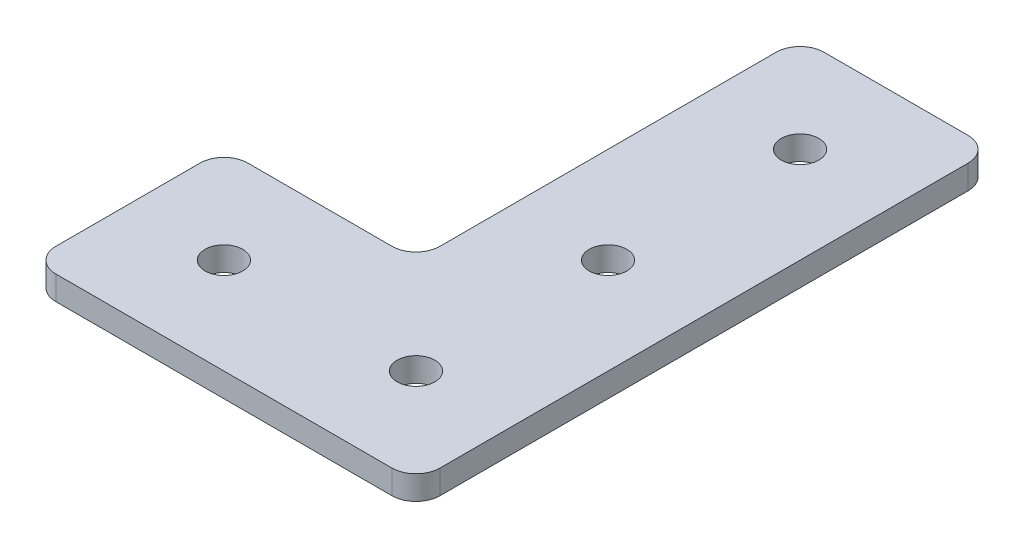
ISO-10303-21;
HEADER;
FILE_DESCRIPTION(('STEP AP214'),'2;1');
FILE_NAME('part.step','',(''),(''),'','','');
FILE_SCHEMA(('AUTOMOTIVE_DESIGN { 1 0 10303 214 1 1 1 1 }'));
ENDSEC;
DATA;
#1=APPLICATION_CONTEXT('core data for automotive mechanical design processes');
#2=APPLICATION_PROTOCOL_DEFINITION('international standard','automotive_design',2000,#1);
#3=PRODUCT_CONTEXT('',#1,'mechanical');
#4=PRODUCT('Part','Part','',(#3));
#5=PRODUCT_RELATED_PRODUCT_CATEGORY('part','',(#4));
#6=PRODUCT_DEFINITION_FORMATION('','',#4);
#7=PRODUCT_DEFINITION_CONTEXT('part definition',#1,'design');
#8=PRODUCT_DEFINITION('design','',#6,#7);
#9=PRODUCT_DEFINITION_SHAPE('','',#8);
#10=(LENGTH_UNIT() NAMED_UNIT(*) SI_UNIT(.MILLI.,.METRE.));
#11=(NAMED_UNIT(*) PLANE_ANGLE_UNIT() SI_UNIT($,.RADIAN.));
#12=(NAMED_UNIT(*) SI_UNIT($,.STERADIAN.) SOLID_ANGLE_UNIT());
#13=UNCERTAINTY_MEASURE_WITH_UNIT(LENGTH_MEASURE(1.E-05),#10,'distance_accuracy_value','');
#14=(GEOMETRIC_REPRESENTATION_CONTEXT(3) GLOBAL_UNCERTAINTY_ASSIGNED_CONTEXT((#13)) GLOBAL_UNIT_ASSIGNED_CONTEXT((#10,
#11,#12)) REPRESENTATION_CONTEXT('',''));
#15=CARTESIAN_POINT('',(0.,0.,0.));
#16=DIRECTION('',(0.,0.,1.));
#17=DIRECTION('',(1.,0.,0.));
#18=AXIS2_PLACEMENT_3D('',#15,#16,#17);
#19=CARTESIAN_POINT('',(0.,3.175,0.));
#20=DIRECTION('',(0.,1.,0.));
#21=DIRECTION('',(0.,0.,1.));
#22=AXIS2_PLACEMENT_3D('',#19,#20,#21);
#23=PLANE('',#22);
#24=CARTESIAN_POINT('',(12.7,3.175,-12.7));
#25=DIRECTION('',(0.,1.,0.));
#26=DIRECTION('',(0.,0.,1.));
#27=AXIS2_PLACEMENT_3D('',#24,#25,#26);
#28=CIRCLE('',#27,2.4892);
#29=CARTESIAN_POINT('',(12.7,3.175,-10.2108));
#30=VERTEX_POINT('',#29);
#31=EDGE_CURVE('E424',#30,#30,#28,.T.);
#32=ORIENTED_EDGE('',*,*,#31,.F.);
#33=EDGE_LOOP('',(#32));
#34=FACE_BOUND('',#33,.T.);
#35=CARTESIAN_POINT('',(12.7,3.175,12.7));
#36=DIRECTION('',(0.,1.,0.));
#37=DIRECTION('',(0.,0.,1.));
#38=AXIS2_PLACEMENT_3D('',#35,#36,#37);
#39=CIRCLE('',#38,2.4892);
#40=CARTESIAN_POINT('',(12.7,3.175,15.1892));
#41=VERTEX_POINT('',#40);
#42=EDGE_CURVE('E234',#41,#41,#39,.T.);
#43=ORIENTED_EDGE('',*,*,#42,.F.);
#44=EDGE_LOOP('',(#43));
#45=FACE_BOUND('',#44,.T.);
#46=DIRECTION('',(1.,0.,0.));
#47=VECTOR('',#46,1.);
#48=CARTESIAN_POINT('',(25.4,3.175,25.4));
#49=LINE('',#48,#47);
#50=CARTESIAN_POINT('',(-22.225,3.175,25.4));
#51=VERTEX_POINT('',#50);
#52=CARTESIAN_POINT('',(22.225,3.175,25.4));
#53=VERTEX_POINT('',#52);
#54=EDGE_CURVE('E223',#51,#53,#49,.T.);
#55=ORIENTED_EDGE('',*,*,#54,.T.);
#56=CARTESIAN_POINT('',(22.225,3.175,22.225));
#57=DIRECTION('',(0.,1.,0.));
#58=DIRECTION('',(0.,0.,1.));
#59=AXIS2_PLACEMENT_3D('',#56,#57,#58);
#60=CIRCLE('',#59,3.175);
#61=CARTESIAN_POINT('',(25.4,3.175,22.225));
#62=VERTEX_POINT('',#61);
#63=EDGE_CURVE('E182',#53,#62,#60,.T.);
#64=ORIENTED_EDGE('',*,*,#63,.T.);
#65=DIRECTION('',(0.,0.,-1.));
#66=VECTOR('',#65,1.);
#67=CARTESIAN_POINT('',(25.4,3.175,-50.8));
#68=LINE('',#67,#66);
#69=CARTESIAN_POINT('',(25.4,3.175,-47.625));
#70=VERTEX_POINT('',#69);
#71=EDGE_CURVE('E145',#62,#70,#68,.T.);
#72=ORIENTED_EDGE('',*,*,#71,.T.);
#73=CARTESIAN_POINT('',(22.225,3.175,-47.625));
#74=DIRECTION('',(0.,1.,0.));
#75=DIRECTION('',(0.,0.,1.));
#76=AXIS2_PLACEMENT_3D('',#73,#74,#75);
#77=CIRCLE('',#76,3.175);
#78=CARTESIAN_POINT('',(22.225,3.175,-50.8));
#79=VERTEX_POINT('',#78);
#80=EDGE_CURVE('E180',#70,#79,#77,.T.);
#81=ORIENTED_EDGE('',*,*,#80,.T.);
#82=DIRECTION('',(-1.,0.,0.));
#83=VECTOR('',#82,1.);
#84=CARTESIAN_POINT('',(0.,3.175,-50.8));
#85=LINE('',#84,#83);
#86=CARTESIAN_POINT('',(3.175,3.175,-50.8));
#87=VERTEX_POINT('',#86);
#88=EDGE_CURVE('E231',#79,#87,#85,.T.);
#89=ORIENTED_EDGE('',*,*,#88,.T.);
#90=CARTESIAN_POINT('',(3.175,3.175,-47.625));
#91=DIRECTION('',(0.,1.,0.));
#92=DIRECTION('',(0.,0.,1.));
#93=AXIS2_PLACEMENT_3D('',#90,#91,#92);
#94=CIRCLE('',#93,3.175);
#95=CARTESIAN_POINT('',(0.,3.175,-47.625));
#96=VERTEX_POINT('',#95);
#97=EDGE_CURVE('E57',#87,#96,#94,.T.);
#98=ORIENTED_EDGE('',*,*,#97,.T.);
#99=DIRECTION('',(0.,0.,1.));
#100=VECTOR('',#99,1.);
#101=CARTESIAN_POINT('',(0.,3.175,0.));
#102=LINE('',#101,#100);
#103=CARTESIAN_POINT('',(0.,3.175,-3.175));
#104=VERTEX_POINT('',#103);
#105=EDGE_CURVE('E164',#96,#104,#102,.T.);
#106=ORIENTED_EDGE('',*,*,#105,.T.);
#107=CARTESIAN_POINT('',(-3.175,3.175,-3.175));
#108=DIRECTION('',(0.,1.,0.));
#109=DIRECTION('',(0.,0.,1.));
#110=AXIS2_PLACEMENT_3D('',#107,#108,#109);
#111=CIRCLE('',#110,3.175);
#112=CARTESIAN_POINT('',(-3.175,3.175,0.));
#113=VERTEX_POINT('',#112);
#114=EDGE_CURVE('E11',#104,#113,#111,.F.);
#115=ORIENTED_EDGE('',*,*,#114,.T.);
#116=DIRECTION('',(-1.,0.,0.));
#117=VECTOR('',#116,1.);
#118=CARTESIAN_POINT('',(-25.4,3.175,0.));
#119=LINE('',#118,#117);
#120=CARTESIAN_POINT('',(-22.225,3.175,0.));
#121=VERTEX_POINT('',#120);
#122=EDGE_CURVE('E163',#113,#121,#119,.T.);
#123=ORIENTED_EDGE('',*,*,#122,.T.);
#124=CARTESIAN_POINT('',(-22.225,3.175,3.175));
#125=DIRECTION('',(0.,1.,0.));
#126=DIRECTION('',(0.,0.,1.));
#127=AXIS2_PLACEMENT_3D('',#124,#125,#126);
#128=CIRCLE('',#127,3.175);
#129=CARTESIAN_POINT('',(-25.4,3.175,3.175));
#130=VERTEX_POINT('',#129);
#131=EDGE_CURVE('E177',#121,#130,#128,.T.);
#132=ORIENTED_EDGE('',*,*,#131,.T.);
#133=DIRECTION('',(0.,0.,1.));
#134=VECTOR('',#133,1.);
#135=CARTESIAN_POINT('',(-25.4,3.175,25.4));
#136=LINE('',#135,#134);
#137=CARTESIAN_POINT('',(-25.4,3.175,22.225));
#138=VERTEX_POINT('',#137);
#139=EDGE_CURVE('E220',#130,#138,#136,.T.);
#140=ORIENTED_EDGE('',*,*,#139,.T.);
#141=CARTESIAN_POINT('',(-22.225,3.175,22.225));
#142=DIRECTION('',(0.,1.,0.));
#143=DIRECTION('',(0.,0.,1.));
#144=AXIS2_PLACEMENT_3D('',#141,#142,#143);
#145=CIRCLE('',#144,3.175);
#146=EDGE_CURVE('E175',#138,#51,#145,.T.);
#147=ORIENTED_EDGE('',*,*,#146,.T.);
#148=EDGE_LOOP('',(#55,#64,#72,#81,#89,#98,#106,#115,#123,#132,#140,#147));
#149=FACE_BOUND('',#148,.T.);
#150=CARTESIAN_POINT('',(-12.7,3.175,12.7));
#151=DIRECTION('',(0.,1.,0.));
#152=DIRECTION('',(0.,0.,1.));
#153=AXIS2_PLACEMENT_3D('',#150,#151,#152);
#154=CIRCLE('',#153,2.4892);
#155=CARTESIAN_POINT('',(-12.7,3.175,15.1892));
#156=VERTEX_POINT('',#155);
#157=EDGE_CURVE('E418',#156,#156,#154,.T.);
#158=ORIENTED_EDGE('',*,*,#157,.F.);
#159=EDGE_LOOP('',(#158));
#160=FACE_BOUND('',#159,.T.);
#161=CARTESIAN_POINT('',(12.7,3.175,-38.1));
#162=DIRECTION('',(0.,1.,0.));
#163=DIRECTION('',(0.,0.,1.));
#164=AXIS2_PLACEMENT_3D('',#161,#162,#163);
#165=CIRCLE('',#164,2.4892);
#166=CARTESIAN_POINT('',(12.7,3.175,-35.6108));
#167=VERTEX_POINT('',#166);
#168=EDGE_CURVE('E430',#167,#167,#165,.T.);
#169=ORIENTED_EDGE('',*,*,#168,.F.);
#170=EDGE_LOOP('',(#169));
#171=FACE_BOUND('',#170,.T.);
#172=ADVANCED_FACE('F35',(#34,#45,#149,#160,#171),#23,.T.);
#173=CARTESIAN_POINT('',(0.,0.,0.));
#174=DIRECTION('',(0.,1.,0.));
#175=DIRECTION('',(0.,0.,1.));
#176=AXIS2_PLACEMENT_3D('',#173,#174,#175);
#177=PLANE('',#176);
#178=DIRECTION('',(0.,0.,-1.));
#179=VECTOR('',#178,1.);
#180=CARTESIAN_POINT('',(25.4,0.,-50.8));
#181=LINE('',#180,#179);
#182=CARTESIAN_POINT('',(25.4,0.,22.225));
#183=VERTEX_POINT('',#182);
#184=CARTESIAN_POINT('',(25.4,0.,-47.625));
#185=VERTEX_POINT('',#184);
#186=EDGE_CURVE('E142',#183,#185,#181,.T.);
#187=ORIENTED_EDGE('',*,*,#186,.F.);
#188=CARTESIAN_POINT('',(22.225,0.,22.225));
#189=DIRECTION('',(0.,1.,0.));
#190=DIRECTION('',(0.,0.,1.));
#191=AXIS2_PLACEMENT_3D('',#188,#189,#190);
#192=CIRCLE('',#191,3.175);
#193=CARTESIAN_POINT('',(22.225,0.,25.4));
#194=VERTEX_POINT('',#193);
#195=EDGE_CURVE('E125',#183,#194,#192,.F.);
#196=ORIENTED_EDGE('',*,*,#195,.T.);
#197=DIRECTION('',(1.,0.,0.));
#198=VECTOR('',#197,1.);
#199=CARTESIAN_POINT('',(25.4,0.,25.4));
#200=LINE('',#199,#198);
#201=CARTESIAN_POINT('',(-22.225,0.,25.4));
#202=VERTEX_POINT('',#201);
#203=EDGE_CURVE('E153',#202,#194,#200,.T.);
#204=ORIENTED_EDGE('',*,*,#203,.F.);
#205=CARTESIAN_POINT('',(-22.225,0.,22.225));
#206=DIRECTION('',(0.,1.,0.));
#207=DIRECTION('',(0.,0.,1.));
#208=AXIS2_PLACEMENT_3D('',#205,#206,#207);
#209=CIRCLE('',#208,3.175);
#210=CARTESIAN_POINT('',(-25.4,0.,22.225));
#211=VERTEX_POINT('',#210);
#212=EDGE_CURVE('E146',#202,#211,#209,.F.);
#213=ORIENTED_EDGE('',*,*,#212,.T.);
#214=DIRECTION('',(0.,0.,1.));
#215=VECTOR('',#214,1.);
#216=CARTESIAN_POINT('',(-25.4,0.,25.4));
#217=LINE('',#216,#215);
#218=CARTESIAN_POINT('',(-25.4,0.,3.175));
#219=VERTEX_POINT('',#218);
#220=EDGE_CURVE('E158',#219,#211,#217,.T.);
#221=ORIENTED_EDGE('',*,*,#220,.F.);
#222=CARTESIAN_POINT('',(-22.225,0.,3.175));
#223=DIRECTION('',(0.,1.,0.));
#224=DIRECTION('',(0.,0.,1.));
#225=AXIS2_PLACEMENT_3D('',#222,#223,#224);
#226=CIRCLE('',#225,3.175);
#227=CARTESIAN_POINT('',(-22.225,0.,0.));
#228=VERTEX_POINT('',#227);
#229=EDGE_CURVE('E167',#219,#228,#226,.F.);
#230=ORIENTED_EDGE('',*,*,#229,.T.);
#231=DIRECTION('',(-1.,0.,0.));
#232=VECTOR('',#231,1.);
#233=CARTESIAN_POINT('',(-25.4,0.,0.));
#234=LINE('',#233,#232);
#235=CARTESIAN_POINT('',(-3.175,0.,0.));
#236=VERTEX_POINT('',#235);
#237=EDGE_CURVE('E205',#236,#228,#234,.T.);
#238=ORIENTED_EDGE('',*,*,#237,.F.);
#239=CARTESIAN_POINT('',(-3.175,0.,-3.175));
#240=DIRECTION('',(0.,1.,0.));
#241=DIRECTION('',(0.,0.,1.));
#242=AXIS2_PLACEMENT_3D('',#239,#240,#241);
#243=CIRCLE('',#242,3.175);
#244=CARTESIAN_POINT('',(0.,0.,-3.175));
#245=VERTEX_POINT('',#244);
#246=EDGE_CURVE('E43',#236,#245,#243,.T.);
#247=ORIENTED_EDGE('',*,*,#246,.T.);
#248=DIRECTION('',(0.,0.,1.));
#249=VECTOR('',#248,1.);
#250=CARTESIAN_POINT('',(0.,0.,0.));
#251=LINE('',#250,#249);
#252=CARTESIAN_POINT('',(0.,0.,-47.625));
#253=VERTEX_POINT('',#252);
#254=EDGE_CURVE('E156',#253,#245,#251,.T.);
#255=ORIENTED_EDGE('',*,*,#254,.F.);
#256=CARTESIAN_POINT('',(3.175,0.,-47.625));
#257=DIRECTION('',(0.,1.,0.));
#258=DIRECTION('',(0.,0.,1.));
#259=AXIS2_PLACEMENT_3D('',#256,#257,#258);
#260=CIRCLE('',#259,3.175);
#261=CARTESIAN_POINT('',(3.175,0.,-50.8));
#262=VERTEX_POINT('',#261);
#263=EDGE_CURVE('E169',#253,#262,#260,.F.);
#264=ORIENTED_EDGE('',*,*,#263,.T.);
#265=DIRECTION('',(-1.,0.,0.));
#266=VECTOR('',#265,1.);
#267=CARTESIAN_POINT('',(0.,0.,-50.8));
#268=LINE('',#267,#266);
#269=CARTESIAN_POINT('',(22.225,0.,-50.8));
#270=VERTEX_POINT('',#269);
#271=EDGE_CURVE('E152',#270,#262,#268,.T.);
#272=ORIENTED_EDGE('',*,*,#271,.F.);
#273=CARTESIAN_POINT('',(22.225,0.,-47.625));
#274=DIRECTION('',(0.,1.,0.));
#275=DIRECTION('',(0.,0.,1.));
#276=AXIS2_PLACEMENT_3D('',#273,#274,#275);
#277=CIRCLE('',#276,3.175);
#278=EDGE_CURVE('E136',#270,#185,#277,.F.);
#279=ORIENTED_EDGE('',*,*,#278,.T.);
#280=EDGE_LOOP('',(#187,#196,#204,#213,#221,#230,#238,#247,#255,#264,#272,#279));
#281=FACE_BOUND('',#280,.T.);
#282=CARTESIAN_POINT('',(12.7,0.,12.7));
#283=DIRECTION('',(0.,1.,0.));
#284=DIRECTION('',(0.,0.,1.));
#285=AXIS2_PLACEMENT_3D('',#282,#283,#284);
#286=CIRCLE('',#285,2.4892);
#287=CARTESIAN_POINT('',(12.7,0.,15.1892));
#288=VERTEX_POINT('',#287);
#289=EDGE_CURVE('E226',#288,#288,#286,.T.);
#290=ORIENTED_EDGE('',*,*,#289,.T.);
#291=EDGE_LOOP('',(#290));
#292=FACE_BOUND('',#291,.T.);
#293=CARTESIAN_POINT('',(-12.7,0.,12.7));
#294=DIRECTION('',(0.,1.,0.));
#295=DIRECTION('',(0.,0.,1.));
#296=AXIS2_PLACEMENT_3D('',#293,#294,#295);
#297=CIRCLE('',#296,2.4892);
#298=CARTESIAN_POINT('',(-12.7,0.,15.1892));
#299=VERTEX_POINT('',#298);
#300=EDGE_CURVE('E420',#299,#299,#297,.T.);
#301=ORIENTED_EDGE('',*,*,#300,.T.);
#302=EDGE_LOOP('',(#301));
#303=FACE_BOUND('',#302,.T.);
#304=CARTESIAN_POINT('',(12.7,0.,-12.7));
#305=DIRECTION('',(0.,1.,0.));
#306=DIRECTION('',(0.,0.,1.));
#307=AXIS2_PLACEMENT_3D('',#304,#305,#306);
#308=CIRCLE('',#307,2.4892);
#309=CARTESIAN_POINT('',(12.7,0.,-10.2108));
#310=VERTEX_POINT('',#309);
#311=EDGE_CURVE('E427',#310,#310,#308,.T.);
#312=ORIENTED_EDGE('',*,*,#311,.T.);
#313=EDGE_LOOP('',(#312));
#314=FACE_BOUND('',#313,.T.);
#315=CARTESIAN_POINT('',(12.7,0.,-38.1));
#316=DIRECTION('',(0.,1.,0.));
#317=DIRECTION('',(0.,0.,1.));
#318=AXIS2_PLACEMENT_3D('',#315,#316,#317);
#319=CIRCLE('',#318,2.4892);
#320=CARTESIAN_POINT('',(12.7,0.,-35.6108));
#321=VERTEX_POINT('',#320);
#322=EDGE_CURVE('E433',#321,#321,#319,.T.);
#323=ORIENTED_EDGE('',*,*,#322,.T.);
#324=EDGE_LOOP('',(#323));
#325=FACE_BOUND('',#324,.T.);
#326=ADVANCED_FACE('F149',(#281,#292,#303,#314,#325),#177,.F.);
#327=CARTESIAN_POINT('',(-25.4,3.175,0.));
#328=DIRECTION('',(0.,0.,1.));
#329=DIRECTION('',(1.,0.,0.));
#330=AXIS2_PLACEMENT_3D('',#327,#328,#329);
#331=PLANE('',#330);
#332=ORIENTED_EDGE('',*,*,#122,.F.);
#333=DIRECTION('',(0.,-1.,0.));
#334=VECTOR('',#333,1.);
#335=CARTESIAN_POINT('',(-3.175,0.,0.));
#336=LINE('',#335,#334);
#337=EDGE_CURVE('E195',#113,#236,#336,.T.);
#338=ORIENTED_EDGE('',*,*,#337,.T.);
#339=ORIENTED_EDGE('',*,*,#237,.T.);
#340=DIRECTION('',(0.,-1.,0.));
#341=VECTOR('',#340,1.);
#342=CARTESIAN_POINT('',(-22.225,3.175,0.));
#343=LINE('',#342,#341);
#344=EDGE_CURVE('E193',#228,#121,#343,.F.);
#345=ORIENTED_EDGE('',*,*,#344,.T.);
#346=EDGE_LOOP('',(#332,#338,#339,#345));
#347=FACE_BOUND('',#346,.T.);
#348=ADVANCED_FACE('F218',(#347),#331,.F.);
#349=CARTESIAN_POINT('',(-25.4,3.175,25.4));
#350=DIRECTION('',(1.,0.,0.));
#351=DIRECTION('',(0.,0.,-1.));
#352=AXIS2_PLACEMENT_3D('',#349,#350,#351);
#353=PLANE('',#352);
#354=ORIENTED_EDGE('',*,*,#139,.F.);
#355=DIRECTION('',(0.,-1.,0.));
#356=VECTOR('',#355,1.);
#357=CARTESIAN_POINT('',(-25.4,3.175,3.175));
#358=LINE('',#357,#356);
#359=EDGE_CURVE('E200',#130,#219,#358,.T.);
#360=ORIENTED_EDGE('',*,*,#359,.T.);
#361=ORIENTED_EDGE('',*,*,#220,.T.);
#362=DIRECTION('',(0.,-1.,0.));
#363=VECTOR('',#362,1.);
#364=CARTESIAN_POINT('',(-25.4,3.175,22.225));
#365=LINE('',#364,#363);
#366=EDGE_CURVE('E198',#211,#138,#365,.F.);
#367=ORIENTED_EDGE('',*,*,#366,.T.);
#368=EDGE_LOOP('',(#354,#360,#361,#367));
#369=FACE_BOUND('',#368,.T.);
#370=ADVANCED_FACE('F240',(#369),#353,.F.);
#371=CARTESIAN_POINT('',(25.4,3.175,25.4));
#372=DIRECTION('',(0.,0.,-1.));
#373=DIRECTION('',(-1.,0.,0.));
#374=AXIS2_PLACEMENT_3D('',#371,#372,#373);
#375=PLANE('',#374);
#376=ORIENTED_EDGE('',*,*,#203,.T.);
#377=DIRECTION('',(0.,-1.,0.));
#378=VECTOR('',#377,1.);
#379=CARTESIAN_POINT('',(22.225,3.175,25.4));
#380=LINE('',#379,#378);
#381=EDGE_CURVE('E130',#194,#53,#380,.F.);
#382=ORIENTED_EDGE('',*,*,#381,.T.);
#383=ORIENTED_EDGE('',*,*,#54,.F.);
#384=DIRECTION('',(0.,-1.,0.));
#385=VECTOR('',#384,1.);
#386=CARTESIAN_POINT('',(-22.225,3.175,25.4));
#387=LINE('',#386,#385);
#388=EDGE_CURVE('E135',#51,#202,#387,.T.);
#389=ORIENTED_EDGE('',*,*,#388,.T.);
#390=EDGE_LOOP('',(#376,#382,#383,#389));
#391=FACE_BOUND('',#390,.T.);
#392=ADVANCED_FACE('F247',(#391),#375,.F.);
#393=CARTESIAN_POINT('',(25.4,3.175,-50.8));
#394=DIRECTION('',(-1.,0.,0.));
#395=DIRECTION('',(0.,0.,1.));
#396=AXIS2_PLACEMENT_3D('',#393,#394,#395);
#397=PLANE('',#396);
#398=ORIENTED_EDGE('',*,*,#71,.F.);
#399=DIRECTION('',(0.,-1.,0.));
#400=VECTOR('',#399,1.);
#401=CARTESIAN_POINT('',(25.4,3.175,22.225));
#402=LINE('',#401,#400);
#403=EDGE_CURVE('E129',#62,#183,#402,.T.);
#404=ORIENTED_EDGE('',*,*,#403,.T.);
#405=ORIENTED_EDGE('',*,*,#186,.T.);
#406=DIRECTION('',(0.,-1.,0.));
#407=VECTOR('',#406,1.);
#408=CARTESIAN_POINT('',(25.4,3.175,-47.625));
#409=LINE('',#408,#407);
#410=EDGE_CURVE('E147',#185,#70,#409,.F.);
#411=ORIENTED_EDGE('',*,*,#410,.T.);
#412=EDGE_LOOP('',(#398,#404,#405,#411));
#413=FACE_BOUND('',#412,.T.);
#414=ADVANCED_FACE('F141',(#413),#397,.F.);
#415=CARTESIAN_POINT('',(0.,3.175,-50.8));
#416=DIRECTION('',(0.,0.,1.));
#417=DIRECTION('',(1.,0.,0.));
#418=AXIS2_PLACEMENT_3D('',#415,#416,#417);
#419=PLANE('',#418);
#420=ORIENTED_EDGE('',*,*,#88,.F.);
#421=DIRECTION('',(0.,-1.,0.));
#422=VECTOR('',#421,1.);
#423=CARTESIAN_POINT('',(22.225,3.175,-50.8));
#424=LINE('',#423,#422);
#425=EDGE_CURVE('E186',#79,#270,#424,.T.);
#426=ORIENTED_EDGE('',*,*,#425,.T.);
#427=ORIENTED_EDGE('',*,*,#271,.T.);
#428=DIRECTION('',(0.,-1.,0.));
#429=VECTOR('',#428,1.);
#430=CARTESIAN_POINT('',(3.175,3.175,-50.8));
#431=LINE('',#430,#429);
#432=EDGE_CURVE('E184',#262,#87,#431,.F.);
#433=ORIENTED_EDGE('',*,*,#432,.T.);
#434=EDGE_LOOP('',(#420,#426,#427,#433));
#435=FACE_BOUND('',#434,.T.);
#436=ADVANCED_FACE('F254',(#435),#419,.F.);
#437=CARTESIAN_POINT('',(0.,3.175,0.));
#438=DIRECTION('',(1.,0.,0.));
#439=DIRECTION('',(0.,0.,-1.));
#440=AXIS2_PLACEMENT_3D('',#437,#438,#439);
#441=PLANE('',#440);
#442=ORIENTED_EDGE('',*,*,#105,.F.);
#443=DIRECTION('',(0.,-1.,0.));
#444=VECTOR('',#443,1.);
#445=CARTESIAN_POINT('',(0.,3.175,-47.625));
#446=LINE('',#445,#444);
#447=EDGE_CURVE('E190',#96,#253,#446,.T.);
#448=ORIENTED_EDGE('',*,*,#447,.T.);
#449=ORIENTED_EDGE('',*,*,#254,.T.);
#450=DIRECTION('',(0.,-1.,0.));
#451=VECTOR('',#450,1.);
#452=CARTESIAN_POINT('',(0.,3.175,-3.175));
#453=LINE('',#452,#451);
#454=EDGE_CURVE('E50',#245,#104,#453,.F.);
#455=ORIENTED_EDGE('',*,*,#454,.T.);
#456=EDGE_LOOP('',(#442,#448,#449,#455));
#457=FACE_BOUND('',#456,.T.);
#458=ADVANCED_FACE('F208',(#457),#441,.F.);
#459=CARTESIAN_POINT('',(12.7,3.175,12.7));
#460=DIRECTION('',(0.,-1.,0.));
#461=DIRECTION('',(0.,0.,-1.));
#462=AXIS2_PLACEMENT_3D('',#459,#460,#461);
#463=CYLINDRICAL_SURFACE('',#462,2.4892);
#464=ORIENTED_EDGE('',*,*,#42,.T.);
#465=EDGE_LOOP('',(#464));
#466=FACE_BOUND('',#465,.T.);
#467=ORIENTED_EDGE('',*,*,#289,.F.);
#468=EDGE_LOOP('',(#467));
#469=FACE_BOUND('',#468,.T.);
#470=ADVANCED_FACE('F267',(#466,#469),#463,.F.);
#471=CARTESIAN_POINT('',(-12.7,3.175,12.7));
#472=DIRECTION('',(0.,-1.,0.));
#473=DIRECTION('',(0.,0.,-1.));
#474=AXIS2_PLACEMENT_3D('',#471,#472,#473);
#475=CYLINDRICAL_SURFACE('',#474,2.4892);
#476=ORIENTED_EDGE('',*,*,#157,.T.);
#477=EDGE_LOOP('',(#476));
#478=FACE_BOUND('',#477,.T.);
#479=ORIENTED_EDGE('',*,*,#300,.F.);
#480=EDGE_LOOP('',(#479));
#481=FACE_BOUND('',#480,.T.);
#482=ADVANCED_FACE('F394',(#478,#481),#475,.F.);
#483=CARTESIAN_POINT('',(12.7,3.175,-12.7));
#484=DIRECTION('',(0.,-1.,0.));
#485=DIRECTION('',(0.,0.,-1.));
#486=AXIS2_PLACEMENT_3D('',#483,#484,#485);
#487=CYLINDRICAL_SURFACE('',#486,2.4892);
#488=ORIENTED_EDGE('',*,*,#31,.T.);
#489=EDGE_LOOP('',(#488));
#490=FACE_BOUND('',#489,.T.);
#491=ORIENTED_EDGE('',*,*,#311,.F.);
#492=EDGE_LOOP('',(#491));
#493=FACE_BOUND('',#492,.T.);
#494=ADVANCED_FACE('F384',(#490,#493),#487,.F.);
#495=CARTESIAN_POINT('',(12.7,3.175,-38.1));
#496=DIRECTION('',(0.,-1.,0.));
#497=DIRECTION('',(0.,0.,-1.));
#498=AXIS2_PLACEMENT_3D('',#495,#496,#497);
#499=CYLINDRICAL_SURFACE('',#498,2.4892);
#500=ORIENTED_EDGE('',*,*,#168,.T.);
#501=EDGE_LOOP('',(#500));
#502=FACE_BOUND('',#501,.T.);
#503=ORIENTED_EDGE('',*,*,#322,.F.);
#504=EDGE_LOOP('',(#503));
#505=FACE_BOUND('',#504,.T.);
#506=ADVANCED_FACE('F291',(#502,#505),#499,.F.);
#507=CARTESIAN_POINT('',(22.225,3.175,22.225));
#508=DIRECTION('',(0.,-1.,0.));
#509=DIRECTION('',(0.,0.,-1.));
#510=AXIS2_PLACEMENT_3D('',#507,#508,#509);
#511=CYLINDRICAL_SURFACE('',#510,3.175);
#512=ORIENTED_EDGE('',*,*,#63,.F.);
#513=ORIENTED_EDGE('',*,*,#381,.F.);
#514=ORIENTED_EDGE('',*,*,#195,.F.);
#515=ORIENTED_EDGE('',*,*,#403,.F.);
#516=EDGE_LOOP('',(#512,#513,#514,#515));
#517=FACE_BOUND('',#516,.T.);
#518=ADVANCED_FACE('F128',(#517),#511,.T.);
#519=CARTESIAN_POINT('',(22.225,3.175,-47.625));
#520=DIRECTION('',(0.,-1.,0.));
#521=DIRECTION('',(0.,0.,-1.));
#522=AXIS2_PLACEMENT_3D('',#519,#520,#521);
#523=CYLINDRICAL_SURFACE('',#522,3.175);
#524=ORIENTED_EDGE('',*,*,#80,.F.);
#525=ORIENTED_EDGE('',*,*,#410,.F.);
#526=ORIENTED_EDGE('',*,*,#278,.F.);
#527=ORIENTED_EDGE('',*,*,#425,.F.);
#528=EDGE_LOOP('',(#524,#525,#526,#527));
#529=FACE_BOUND('',#528,.T.);
#530=ADVANCED_FACE('F281',(#529),#523,.T.);
#531=CARTESIAN_POINT('',(3.175,3.175,-47.625));
#532=DIRECTION('',(0.,-1.,0.));
#533=DIRECTION('',(0.,0.,-1.));
#534=AXIS2_PLACEMENT_3D('',#531,#532,#533);
#535=CYLINDRICAL_SURFACE('',#534,3.175);
#536=ORIENTED_EDGE('',*,*,#97,.F.);
#537=ORIENTED_EDGE('',*,*,#432,.F.);
#538=ORIENTED_EDGE('',*,*,#263,.F.);
#539=ORIENTED_EDGE('',*,*,#447,.F.);
#540=EDGE_LOOP('',(#536,#537,#538,#539));
#541=FACE_BOUND('',#540,.T.);
#542=ADVANCED_FACE('F283',(#541),#535,.T.);
#543=CARTESIAN_POINT('',(-3.175,3.175,-3.175));
#544=DIRECTION('',(0.,1.,0.));
#545=DIRECTION('',(0.,0.,1.));
#546=AXIS2_PLACEMENT_3D('',#543,#544,#545);
#547=CYLINDRICAL_SURFACE('',#546,3.175);
#548=ORIENTED_EDGE('',*,*,#114,.F.);
#549=ORIENTED_EDGE('',*,*,#454,.F.);
#550=ORIENTED_EDGE('',*,*,#246,.F.);
#551=ORIENTED_EDGE('',*,*,#337,.F.);
#552=EDGE_LOOP('',(#548,#549,#550,#551));
#553=FACE_BOUND('',#552,.T.);
#554=ADVANCED_FACE('F211',(#553),#547,.F.);
#555=CARTESIAN_POINT('',(-22.225,3.175,3.175));
#556=DIRECTION('',(0.,-1.,0.));
#557=DIRECTION('',(0.,0.,-1.));
#558=AXIS2_PLACEMENT_3D('',#555,#556,#557);
#559=CYLINDRICAL_SURFACE('',#558,3.175);
#560=ORIENTED_EDGE('',*,*,#131,.F.);
#561=ORIENTED_EDGE('',*,*,#344,.F.);
#562=ORIENTED_EDGE('',*,*,#229,.F.);
#563=ORIENTED_EDGE('',*,*,#359,.F.);
#564=EDGE_LOOP('',(#560,#561,#562,#563));
#565=FACE_BOUND('',#564,.T.);
#566=ADVANCED_FACE('F296',(#565),#559,.T.);
#567=CARTESIAN_POINT('',(-22.225,3.175,22.225));
#568=DIRECTION('',(0.,-1.,0.));
#569=DIRECTION('',(0.,0.,-1.));
#570=AXIS2_PLACEMENT_3D('',#567,#568,#569);
#571=CYLINDRICAL_SURFACE('',#570,3.175);
#572=ORIENTED_EDGE('',*,*,#146,.F.);
#573=ORIENTED_EDGE('',*,*,#366,.F.);
#574=ORIENTED_EDGE('',*,*,#212,.F.);
#575=ORIENTED_EDGE('',*,*,#388,.F.);
#576=EDGE_LOOP('',(#572,#573,#574,#575));
#577=FACE_BOUND('',#576,.T.);
#578=ADVANCED_FACE('F37',(#577),#571,.T.);
#579=CLOSED_SHELL('',(#172,#326,#348,#370,#392,#414,#436,#458,#470,#482,#494,#506,#518,#530,
#542,#554,#566,#578));
#580=MANIFOLD_SOLID_BREP('B2',#579);
#581=ADVANCED_BREP_SHAPE_REPRESENTATION('',(#18,#580),#14);
#582=SHAPE_DEFINITION_REPRESENTATION(#9,#581);
ENDSEC;
END-ISO-10303-21;
